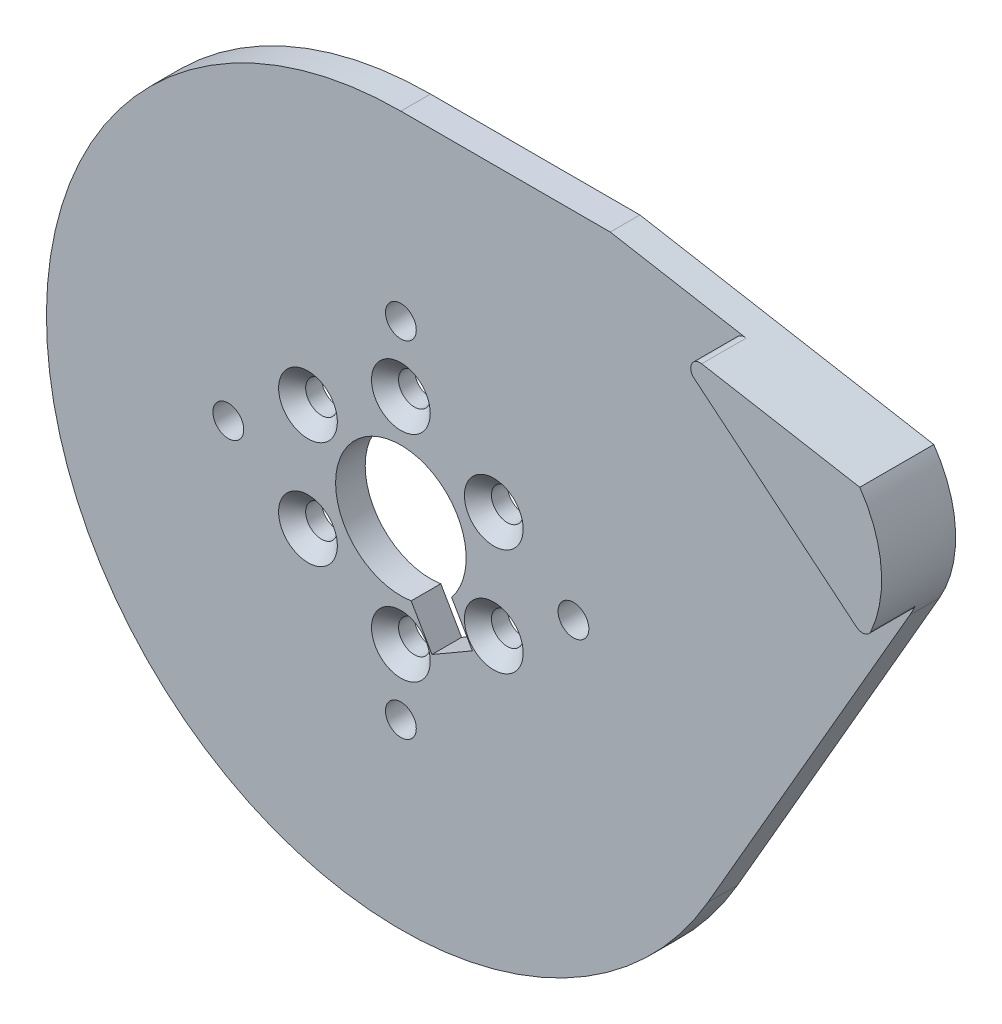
ISO-10303-21;
HEADER;
FILE_DESCRIPTION(('STEP AP214'),'2;1');
FILE_NAME('part.step','',(''),(''),'','','');
FILE_SCHEMA(('AUTOMOTIVE_DESIGN { 1 0 10303 214 1 1 1 1 }'));
ENDSEC;
DATA;
#1=APPLICATION_CONTEXT('core data for automotive mechanical design processes');
#2=APPLICATION_PROTOCOL_DEFINITION('international standard','automotive_design',2000,#1);
#3=PRODUCT_CONTEXT('',#1,'mechanical');
#4=PRODUCT('Part','Part','',(#3));
#5=PRODUCT_RELATED_PRODUCT_CATEGORY('part','',(#4));
#6=PRODUCT_DEFINITION_FORMATION('','',#4);
#7=PRODUCT_DEFINITION_CONTEXT('part definition',#1,'design');
#8=PRODUCT_DEFINITION('design','',#6,#7);
#9=PRODUCT_DEFINITION_SHAPE('','',#8);
#10=(LENGTH_UNIT() NAMED_UNIT(*) SI_UNIT(.MILLI.,.METRE.));
#11=(NAMED_UNIT(*) PLANE_ANGLE_UNIT() SI_UNIT($,.RADIAN.));
#12=(NAMED_UNIT(*) SI_UNIT($,.STERADIAN.) SOLID_ANGLE_UNIT());
#13=UNCERTAINTY_MEASURE_WITH_UNIT(LENGTH_MEASURE(1.E-05),#10,'distance_accuracy_value','');
#14=(GEOMETRIC_REPRESENTATION_CONTEXT(3) GLOBAL_UNCERTAINTY_ASSIGNED_CONTEXT((#13)) GLOBAL_UNIT_ASSIGNED_CONTEXT((#10,
#11,#12)) REPRESENTATION_CONTEXT('',''));
#15=CARTESIAN_POINT('',(0.,0.,0.));
#16=DIRECTION('',(0.,0.,1.));
#17=DIRECTION('',(1.,0.,0.));
#18=AXIS2_PLACEMENT_3D('',#15,#16,#17);
#19=CARTESIAN_POINT('',(43.3012701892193,24.9999999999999,0.));
#20=DIRECTION('',(0.,0.,1.));
#21=DIRECTION('',(1.,0.,0.));
#22=AXIS2_PLACEMENT_3D('',#19,#20,#21);
#23=CYLINDRICAL_SURFACE('',#22,13.0000000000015);
#24=CARTESIAN_POINT('',(43.3012701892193,24.9999999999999,3.175));
#25=DIRECTION('',(0.,0.,1.));
#26=DIRECTION('',(1.,0.,0.));
#27=AXIS2_PLACEMENT_3D('',#24,#25,#26);
#28=CIRCLE('',#27,13.0000000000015);
#29=CARTESIAN_POINT('',(54.5596004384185,18.4999999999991,3.175));
#30=VERTEX_POINT('',#29);
#31=CARTESIAN_POINT('',(55.1499676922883,19.6513209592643,3.175));
#32=VERTEX_POINT('',#31);
#33=EDGE_CURVE('E147',#30,#32,#28,.T.);
#34=ORIENTED_EDGE('',*,*,#33,.F.);
#35=DIRECTION('',(0.,0.,1.));
#36=VECTOR('',#35,1.);
#37=CARTESIAN_POINT('',(54.5596004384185,18.4999999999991,0.));
#38=LINE('',#37,#36);
#39=CARTESIAN_POINT('',(54.5596004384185,18.4999999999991,0.));
#40=VERTEX_POINT('',#39);
#41=EDGE_CURVE('E11',#40,#30,#38,.T.);
#42=ORIENTED_EDGE('',*,*,#41,.F.);
#43=CARTESIAN_POINT('',(43.3012701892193,24.9999999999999,0.));
#44=DIRECTION('',(0.,0.,1.));
#45=DIRECTION('',(1.,0.,0.));
#46=AXIS2_PLACEMENT_3D('',#43,#44,#45);
#47=CIRCLE('',#46,13.0000000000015);
#48=CARTESIAN_POINT('',(53.9595020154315,32.4432583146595,0.));
#49=VERTEX_POINT('',#48);
#50=EDGE_CURVE('E170',#40,#49,#47,.T.);
#51=ORIENTED_EDGE('',*,*,#50,.T.);
#52=DIRECTION('',(0.,0.,1.));
#53=VECTOR('',#52,1.);
#54=CARTESIAN_POINT('',(53.9595020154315,32.4432583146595,0.));
#55=LINE('',#54,#53);
#56=CARTESIAN_POINT('',(53.9595020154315,32.4432583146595,7.9375));
#57=VERTEX_POINT('',#56);
#58=EDGE_CURVE('E36',#49,#57,#55,.T.);
#59=ORIENTED_EDGE('',*,*,#58,.T.);
#60=CARTESIAN_POINT('',(43.3012701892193,24.9999999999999,7.9375));
#61=DIRECTION('',(0.,0.,1.));
#62=DIRECTION('',(-1.,0.,0.));
#63=AXIS2_PLACEMENT_3D('',#60,#61,#62);
#64=CIRCLE('',#63,13.0000000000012);
#65=CARTESIAN_POINT('',(55.149967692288,19.6513209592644,7.9375));
#66=VERTEX_POINT('',#65);
#67=EDGE_CURVE('E208',#66,#57,#64,.T.);
#68=ORIENTED_EDGE('',*,*,#67,.F.);
#69=DIRECTION('',(0.,0.,-1.));
#70=VECTOR('',#69,1.);
#71=CARTESIAN_POINT('',(55.149967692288,19.6513209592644,7.9375));
#72=LINE('',#71,#70);
#73=EDGE_CURVE('E226',#66,#32,#72,.T.);
#74=ORIENTED_EDGE('',*,*,#73,.T.);
#75=EDGE_LOOP('',(#34,#42,#51,#59,#68,#74));
#76=FACE_BOUND('',#75,.T.);
#77=ADVANCED_FACE('F33',(#76),#23,.T.);
#78=CARTESIAN_POINT('',(32.9089653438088,-18.9999999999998,0.));
#79=DIRECTION('',(0.866025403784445,-0.499999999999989,0.));
#80=DIRECTION('',(0.499999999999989,0.866025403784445,0.));
#81=AXIS2_PLACEMENT_3D('',#78,#79,#80);
#82=PLANE('',#81);
#83=DIRECTION('',(0.499999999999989,0.866025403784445,0.));
#84=VECTOR('',#83,1.);
#85=CARTESIAN_POINT('',(32.9089653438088,-18.9999999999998,3.175));
#86=LINE('',#85,#84);
#87=CARTESIAN_POINT('',(32.9089653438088,-18.9999999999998,3.175));
#88=VERTEX_POINT('',#87);
#89=EDGE_CURVE('E174',#88,#30,#86,.T.);
#90=ORIENTED_EDGE('',*,*,#89,.F.);
#91=DIRECTION('',(0.,0.,1.));
#92=VECTOR('',#91,1.);
#93=CARTESIAN_POINT('',(32.9089653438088,-18.9999999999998,0.));
#94=LINE('',#93,#92);
#95=CARTESIAN_POINT('',(32.9089653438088,-18.9999999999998,0.));
#96=VERTEX_POINT('',#95);
#97=EDGE_CURVE('E41',#96,#88,#94,.T.);
#98=ORIENTED_EDGE('',*,*,#97,.F.);
#99=DIRECTION('',(0.499999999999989,0.866025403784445,0.));
#100=VECTOR('',#99,1.);
#101=CARTESIAN_POINT('',(32.9089653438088,-18.9999999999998,0.));
#102=LINE('',#101,#100);
#103=EDGE_CURVE('E183',#96,#40,#102,.T.);
#104=ORIENTED_EDGE('',*,*,#103,.T.);
#105=ORIENTED_EDGE('',*,*,#41,.T.);
#106=EDGE_LOOP('',(#90,#98,#104,#105));
#107=FACE_BOUND('',#106,.T.);
#108=ADVANCED_FACE('F263',(#107),#82,.T.);
#109=CARTESIAN_POINT('',(0.,1.23512311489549E-12,0.));
#110=DIRECTION('',(0.,0.,1.));
#111=DIRECTION('',(1.,0.,0.));
#112=AXIS2_PLACEMENT_3D('',#109,#110,#111);
#113=CYLINDRICAL_SURFACE('',#112,38.0000000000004);
#114=CARTESIAN_POINT('',(0.,1.23512311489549E-12,3.175));
#115=DIRECTION('',(0.,0.,1.));
#116=DIRECTION('',(1.,0.,0.));
#117=AXIS2_PLACEMENT_3D('',#114,#115,#116);
#118=CIRCLE('',#117,38.0000000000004);
#119=CARTESIAN_POINT('',(0.,38.0000000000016,3.175));
#120=VERTEX_POINT('',#119);
#121=EDGE_CURVE('E192',#120,#88,#118,.T.);
#122=ORIENTED_EDGE('',*,*,#121,.F.);
#123=DIRECTION('',(0.,0.,1.));
#124=VECTOR('',#123,1.);
#125=CARTESIAN_POINT('',(0.,38.0000000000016,0.));
#126=LINE('',#125,#124);
#127=CARTESIAN_POINT('',(0.,38.0000000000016,0.));
#128=VERTEX_POINT('',#127);
#129=EDGE_CURVE('E198',#128,#120,#126,.T.);
#130=ORIENTED_EDGE('',*,*,#129,.F.);
#131=CARTESIAN_POINT('',(0.,1.23512311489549E-12,0.));
#132=DIRECTION('',(0.,0.,1.));
#133=DIRECTION('',(1.,0.,0.));
#134=AXIS2_PLACEMENT_3D('',#131,#132,#133);
#135=CIRCLE('',#134,38.0000000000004);
#136=EDGE_CURVE('E180',#128,#96,#135,.T.);
#137=ORIENTED_EDGE('',*,*,#136,.T.);
#138=ORIENTED_EDGE('',*,*,#97,.T.);
#139=EDGE_LOOP('',(#122,#130,#137,#138));
#140=FACE_BOUND('',#139,.T.);
#141=ADVANCED_FACE('F267',(#140),#113,.T.);
#142=CARTESIAN_POINT('',(22.4456539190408,38.0000000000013,0.));
#143=DIRECTION('',(0.,1.,0.));
#144=DIRECTION('',(-1.,0.,0.));
#145=AXIS2_PLACEMENT_3D('',#142,#143,#144);
#146=PLANE('',#145);
#147=DIRECTION('',(-1.,0.,0.));
#148=VECTOR('',#147,1.);
#149=CARTESIAN_POINT('',(22.4456539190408,38.0000000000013,3.175));
#150=LINE('',#149,#148);
#151=CARTESIAN_POINT('',(22.4456539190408,38.0000000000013,3.175));
#152=VERTEX_POINT('',#151);
#153=EDGE_CURVE('E189',#152,#120,#150,.T.);
#154=ORIENTED_EDGE('',*,*,#153,.F.);
#155=DIRECTION('',(0.,0.,1.));
#156=VECTOR('',#155,1.);
#157=CARTESIAN_POINT('',(22.4456539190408,38.0000000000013,0.));
#158=LINE('',#157,#156);
#159=CARTESIAN_POINT('',(22.4456539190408,38.0000000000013,0.));
#160=VERTEX_POINT('',#159);
#161=EDGE_CURVE('E199',#160,#152,#158,.T.);
#162=ORIENTED_EDGE('',*,*,#161,.F.);
#163=DIRECTION('',(-1.,0.,0.));
#164=VECTOR('',#163,1.);
#165=CARTESIAN_POINT('',(22.4456539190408,38.0000000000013,0.));
#166=LINE('',#165,#164);
#167=EDGE_CURVE('E177',#160,#128,#166,.T.);
#168=ORIENTED_EDGE('',*,*,#167,.T.);
#169=ORIENTED_EDGE('',*,*,#129,.T.);
#170=EDGE_LOOP('',(#154,#162,#168,#169));
#171=FACE_BOUND('',#170,.T.);
#172=ADVANCED_FACE('F273',(#171),#146,.T.);
#173=CARTESIAN_POINT('',(53.9595020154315,32.4432583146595,0.));
#174=DIRECTION('',(0.173648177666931,0.984807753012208,0.));
#175=DIRECTION('',(-0.984807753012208,0.173648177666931,0.));
#176=AXIS2_PLACEMENT_3D('',#173,#174,#175);
#177=PLANE('',#176);
#178=DIRECTION('',(-0.984807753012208,0.173648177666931,0.));
#179=VECTOR('',#178,1.);
#180=CARTESIAN_POINT('',(53.9595020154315,32.4432583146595,3.175));
#181=LINE('',#180,#179);
#182=CARTESIAN_POINT('',(37.0091232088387,35.4320674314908,3.175));
#183=VERTEX_POINT('',#182);
#184=EDGE_CURVE('E187',#183,#152,#181,.T.);
#185=ORIENTED_EDGE('',*,*,#184,.F.);
#186=DIRECTION('',(0.,0.,-1.));
#187=VECTOR('',#186,1.);
#188=CARTESIAN_POINT('',(37.0091232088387,35.4320674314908,7.9375));
#189=LINE('',#188,#187);
#190=CARTESIAN_POINT('',(37.0091232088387,35.4320674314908,7.9375));
#191=VERTEX_POINT('',#190);
#192=EDGE_CURVE('E223',#191,#183,#189,.T.);
#193=ORIENTED_EDGE('',*,*,#192,.F.);
#194=DIRECTION('',(-0.984807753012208,0.173648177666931,0.));
#195=VECTOR('',#194,1.);
#196=CARTESIAN_POINT('',(37.0091232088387,35.4320674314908,7.9375));
#197=LINE('',#196,#195);
#198=EDGE_CURVE('E215',#57,#191,#197,.T.);
#199=ORIENTED_EDGE('',*,*,#198,.F.);
#200=ORIENTED_EDGE('',*,*,#58,.F.);
#201=DIRECTION('',(-0.984807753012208,0.173648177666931,0.));
#202=VECTOR('',#201,1.);
#203=CARTESIAN_POINT('',(53.9595020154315,32.4432583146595,0.));
#204=LINE('',#203,#202);
#205=EDGE_CURVE('E173',#49,#160,#204,.T.);
#206=ORIENTED_EDGE('',*,*,#205,.T.);
#207=ORIENTED_EDGE('',*,*,#161,.T.);
#208=EDGE_LOOP('',(#185,#193,#199,#200,#206,#207));
#209=FACE_BOUND('',#208,.T.);
#210=ADVANCED_FACE('F221',(#209),#177,.T.);
#211=CARTESIAN_POINT('',(43.3012701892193,24.9999999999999,0.));
#212=DIRECTION('',(0.,0.,1.));
#213=DIRECTION('',(1.,0.,0.));
#214=AXIS2_PLACEMENT_3D('',#211,#212,#213);
#215=PLANE('',#214);
#216=CARTESIAN_POINT('',(-9.95929214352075,5.74999999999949,0.));
#217=DIRECTION('',(0.,0.,1.));
#218=DIRECTION('',(1.,0.,0.));
#219=AXIS2_PLACEMENT_3D('',#216,#217,#218);
#220=CIRCLE('',#219,1.69999999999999);
#221=CARTESIAN_POINT('',(-8.25929214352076,5.74999999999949,0.));
#222=VERTEX_POINT('',#221);
#223=EDGE_CURVE('E574',#222,#222,#220,.T.);
#224=ORIENTED_EDGE('',*,*,#223,.T.);
#225=EDGE_LOOP('',(#224));
#226=FACE_BOUND('',#225,.T.);
#227=CARTESIAN_POINT('',(-9.95929214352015,-5.75000000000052,0.));
#228=DIRECTION('',(0.,0.,1.));
#229=DIRECTION('',(1.,0.,0.));
#230=AXIS2_PLACEMENT_3D('',#227,#228,#229);
#231=CIRCLE('',#230,1.69999999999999);
#232=CARTESIAN_POINT('',(-8.25929214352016,-5.75000000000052,0.));
#233=VERTEX_POINT('',#232);
#234=EDGE_CURVE('E565',#233,#233,#231,.T.);
#235=ORIENTED_EDGE('',*,*,#234,.T.);
#236=EDGE_LOOP('',(#235));
#237=FACE_BOUND('',#236,.T.);
#238=CARTESIAN_POINT('',(1.19132134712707E-12,-11.5,0.));
#239=DIRECTION('',(0.,0.,1.));
#240=DIRECTION('',(1.,0.,0.));
#241=AXIS2_PLACEMENT_3D('',#238,#239,#240);
#242=CIRCLE('',#241,1.69999999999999);
#243=CARTESIAN_POINT('',(1.70000000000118,-11.5,0.));
#244=VERTEX_POINT('',#243);
#245=EDGE_CURVE('E556',#244,#244,#242,.T.);
#246=ORIENTED_EDGE('',*,*,#245,.T.);
#247=EDGE_LOOP('',(#246));
#248=FACE_BOUND('',#247,.T.);
#249=CARTESIAN_POINT('',(9.95929214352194,-5.74999999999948,0.));
#250=DIRECTION('',(0.,0.,1.));
#251=DIRECTION('',(1.,0.,0.));
#252=AXIS2_PLACEMENT_3D('',#249,#250,#251);
#253=CIRCLE('',#252,1.69999999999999);
#254=CARTESIAN_POINT('',(11.6592921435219,-5.74999999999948,0.));
#255=VERTEX_POINT('',#254);
#256=EDGE_CURVE('E547',#255,#255,#253,.T.);
#257=ORIENTED_EDGE('',*,*,#256,.T.);
#258=EDGE_LOOP('',(#257));
#259=FACE_BOUND('',#258,.T.);
#260=CARTESIAN_POINT('',(9.95929214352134,5.75000000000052,0.));
#261=DIRECTION('',(0.,0.,1.));
#262=DIRECTION('',(1.,0.,0.));
#263=AXIS2_PLACEMENT_3D('',#260,#261,#262);
#264=CIRCLE('',#263,1.69999999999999);
#265=CARTESIAN_POINT('',(11.6592921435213,5.75000000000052,0.));
#266=VERTEX_POINT('',#265);
#267=EDGE_CURVE('E538',#266,#266,#264,.T.);
#268=ORIENTED_EDGE('',*,*,#267,.T.);
#269=EDGE_LOOP('',(#268));
#270=FACE_BOUND('',#269,.T.);
#271=CARTESIAN_POINT('',(0.,11.5,0.));
#272=DIRECTION('',(0.,0.,1.));
#273=DIRECTION('',(1.,0.,0.));
#274=AXIS2_PLACEMENT_3D('',#271,#272,#273);
#275=CIRCLE('',#274,1.69999999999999);
#276=CARTESIAN_POINT('',(1.69999999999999,11.5,0.));
#277=VERTEX_POINT('',#276);
#278=EDGE_CURVE('E529',#277,#277,#275,.T.);
#279=ORIENTED_EDGE('',*,*,#278,.T.);
#280=EDGE_LOOP('',(#279));
#281=FACE_BOUND('',#280,.T.);
#282=CARTESIAN_POINT('',(18.5000000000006,5.80012052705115E-13,0.));
#283=DIRECTION('',(0.,0.,1.));
#284=DIRECTION('',(1.,0.,0.));
#285=AXIS2_PLACEMENT_3D('',#282,#283,#284);
#286=CIRCLE('',#285,1.64999999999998);
#287=CARTESIAN_POINT('',(20.1500000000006,5.80012052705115E-13,0.));
#288=VERTEX_POINT('',#287);
#289=EDGE_CURVE('E523',#288,#288,#286,.T.);
#290=ORIENTED_EDGE('',*,*,#289,.T.);
#291=EDGE_LOOP('',(#290));
#292=FACE_BOUND('',#291,.T.);
#293=CARTESIAN_POINT('',(1.16002410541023E-12,-18.5,0.));
#294=DIRECTION('',(0.,0.,1.));
#295=DIRECTION('',(1.,0.,0.));
#296=AXIS2_PLACEMENT_3D('',#293,#294,#295);
#297=CIRCLE('',#296,1.64999999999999);
#298=CARTESIAN_POINT('',(1.65000000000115,-18.5,0.));
#299=VERTEX_POINT('',#298);
#300=EDGE_CURVE('E517',#299,#299,#297,.T.);
#301=ORIENTED_EDGE('',*,*,#300,.T.);
#302=EDGE_LOOP('',(#301));
#303=FACE_BOUND('',#302,.T.);
#304=CARTESIAN_POINT('',(-18.4999999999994,-5.82277649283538E-13,0.));
#305=DIRECTION('',(0.,0.,1.));
#306=DIRECTION('',(1.,0.,0.));
#307=AXIS2_PLACEMENT_3D('',#304,#305,#306);
#308=CIRCLE('',#307,1.64999999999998);
#309=CARTESIAN_POINT('',(-16.8499999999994,-5.82277649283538E-13,0.));
#310=VERTEX_POINT('',#309);
#311=EDGE_CURVE('E511',#310,#310,#308,.T.);
#312=ORIENTED_EDGE('',*,*,#311,.T.);
#313=EDGE_LOOP('',(#312));
#314=FACE_BOUND('',#313,.T.);
#315=CARTESIAN_POINT('',(0.,18.5,0.));
#316=DIRECTION('',(0.,0.,1.));
#317=DIRECTION('',(1.,0.,0.));
#318=AXIS2_PLACEMENT_3D('',#315,#316,#317);
#319=CIRCLE('',#318,1.64999999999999);
#320=CARTESIAN_POINT('',(1.64999999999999,18.5,0.));
#321=VERTEX_POINT('',#320);
#322=EDGE_CURVE('E138',#321,#321,#319,.T.);
#323=ORIENTED_EDGE('',*,*,#322,.T.);
#324=EDGE_LOOP('',(#323));
#325=FACE_BOUND('',#324,.T.);
#326=DIRECTION('',(0.5,-0.866025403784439,0.));
#327=VECTOR('',#326,1.);
#328=CARTESIAN_POINT('',(5.43423771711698,-4.4123758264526,0.));
#329=LINE('',#328,#327);
#330=CARTESIAN_POINT('',(5.43423771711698,-4.4123758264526,0.));
#331=VERTEX_POINT('',#330);
#332=CARTESIAN_POINT('',(7.66506350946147,-8.27627944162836,0.));
#333=VERTEX_POINT('',#332);
#334=EDGE_CURVE('E143',#331,#333,#329,.T.);
#335=ORIENTED_EDGE('',*,*,#334,.F.);
#336=CARTESIAN_POINT('',(0.,0.,0.));
#337=DIRECTION('',(0.,0.,-1.));
#338=DIRECTION('',(-1.,0.,0.));
#339=AXIS2_PLACEMENT_3D('',#336,#337,#338);
#340=CIRCLE('',#339,7.);
#341=CARTESIAN_POINT('',(1.10411069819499,-6.91237582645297,0.));
#342=VERTEX_POINT('',#341);
#343=EDGE_CURVE('E126',#342,#331,#340,.T.);
#344=ORIENTED_EDGE('',*,*,#343,.F.);
#345=DIRECTION('',(-0.5,0.866025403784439,0.));
#346=VECTOR('',#345,1.);
#347=CARTESIAN_POINT('',(3.33493649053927,-10.7762794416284,0.));
#348=LINE('',#347,#346);
#349=CARTESIAN_POINT('',(3.33493649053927,-10.7762794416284,0.));
#350=VERTEX_POINT('',#349);
#351=EDGE_CURVE('E156',#350,#342,#348,.T.);
#352=ORIENTED_EDGE('',*,*,#351,.F.);
#353=DIRECTION('',(-0.866025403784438,-0.5,0.));
#354=VECTOR('',#353,1.);
#355=CARTESIAN_POINT('',(7.66506350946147,-8.27627944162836,0.));
#356=LINE('',#355,#354);
#357=EDGE_CURVE('E153',#333,#350,#356,.T.);
#358=ORIENTED_EDGE('',*,*,#357,.F.);
#359=EDGE_LOOP('',(#335,#344,#352,#358));
#360=FACE_BOUND('',#359,.T.);
#361=ORIENTED_EDGE('',*,*,#50,.F.);
#362=ORIENTED_EDGE('',*,*,#103,.F.);
#363=ORIENTED_EDGE('',*,*,#136,.F.);
#364=ORIENTED_EDGE('',*,*,#167,.F.);
#365=ORIENTED_EDGE('',*,*,#205,.F.);
#366=EDGE_LOOP('',(#361,#362,#363,#364,#365));
#367=FACE_BOUND('',#366,.T.);
#368=ADVANCED_FACE('F150',(#226,#237,#248,#259,#270,#281,#292,#303,#314,#325,#360,#367),#215,.F.);
#369=CARTESIAN_POINT('',(43.3012701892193,24.9999999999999,3.175));
#370=DIRECTION('',(0.,0.,1.));
#371=DIRECTION('',(1.,0.,0.));
#372=AXIS2_PLACEMENT_3D('',#369,#370,#371);
#373=PLANE('',#372);
#374=CARTESIAN_POINT('',(-9.95929214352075,5.74999999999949,3.175));
#375=DIRECTION('',(0.,0.,1.));
#376=DIRECTION('',(1.,0.,0.));
#377=AXIS2_PLACEMENT_3D('',#374,#375,#376);
#378=CIRCLE('',#377,3.1499999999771);
#379=CARTESIAN_POINT('',(-6.80929214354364,5.74999999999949,3.175));
#380=VERTEX_POINT('',#379);
#381=EDGE_CURVE('E579',#380,#380,#378,.T.);
#382=ORIENTED_EDGE('',*,*,#381,.F.);
#383=EDGE_LOOP('',(#382));
#384=FACE_BOUND('',#383,.T.);
#385=CARTESIAN_POINT('',(-9.95929214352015,-5.75000000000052,3.175));
#386=DIRECTION('',(0.,0.,1.));
#387=DIRECTION('',(1.,0.,0.));
#388=AXIS2_PLACEMENT_3D('',#385,#386,#387);
#389=CIRCLE('',#388,3.1499999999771);
#390=CARTESIAN_POINT('',(-6.80929214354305,-5.75000000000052,3.175));
#391=VERTEX_POINT('',#390);
#392=EDGE_CURVE('E571',#391,#391,#389,.T.);
#393=ORIENTED_EDGE('',*,*,#392,.F.);
#394=EDGE_LOOP('',(#393));
#395=FACE_BOUND('',#394,.T.);
#396=CARTESIAN_POINT('',(1.19132134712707E-12,-11.5,3.175));
#397=DIRECTION('',(0.,0.,1.));
#398=DIRECTION('',(1.,0.,0.));
#399=AXIS2_PLACEMENT_3D('',#396,#397,#398);
#400=CIRCLE('',#399,3.1499999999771);
#401=CARTESIAN_POINT('',(3.14999999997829,-11.5,3.175));
#402=VERTEX_POINT('',#401);
#403=EDGE_CURVE('E562',#402,#402,#400,.T.);
#404=ORIENTED_EDGE('',*,*,#403,.F.);
#405=EDGE_LOOP('',(#404));
#406=FACE_BOUND('',#405,.T.);
#407=CARTESIAN_POINT('',(9.95929214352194,-5.74999999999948,3.175));
#408=DIRECTION('',(0.,0.,1.));
#409=DIRECTION('',(1.,0.,0.));
#410=AXIS2_PLACEMENT_3D('',#407,#408,#409);
#411=CIRCLE('',#410,3.1499999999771);
#412=CARTESIAN_POINT('',(13.109292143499,-5.74999999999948,3.175));
#413=VERTEX_POINT('',#412);
#414=EDGE_CURVE('E553',#413,#413,#411,.T.);
#415=ORIENTED_EDGE('',*,*,#414,.F.);
#416=EDGE_LOOP('',(#415));
#417=FACE_BOUND('',#416,.T.);
#418=CARTESIAN_POINT('',(9.95929214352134,5.75000000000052,3.175));
#419=DIRECTION('',(0.,0.,1.));
#420=DIRECTION('',(1.,0.,0.));
#421=AXIS2_PLACEMENT_3D('',#418,#419,#420);
#422=CIRCLE('',#421,3.1499999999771);
#423=CARTESIAN_POINT('',(13.1092921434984,5.75000000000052,3.175));
#424=VERTEX_POINT('',#423);
#425=EDGE_CURVE('E544',#424,#424,#422,.T.);
#426=ORIENTED_EDGE('',*,*,#425,.F.);
#427=EDGE_LOOP('',(#426));
#428=FACE_BOUND('',#427,.T.);
#429=CARTESIAN_POINT('',(0.,11.5,3.175));
#430=DIRECTION('',(0.,0.,1.));
#431=DIRECTION('',(1.,0.,0.));
#432=AXIS2_PLACEMENT_3D('',#429,#430,#431);
#433=CIRCLE('',#432,3.1499999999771);
#434=CARTESIAN_POINT('',(3.1499999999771,11.5,3.175));
#435=VERTEX_POINT('',#434);
#436=EDGE_CURVE('E535',#435,#435,#433,.T.);
#437=ORIENTED_EDGE('',*,*,#436,.F.);
#438=EDGE_LOOP('',(#437));
#439=FACE_BOUND('',#438,.T.);
#440=CARTESIAN_POINT('',(18.5000000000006,5.80012052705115E-13,3.175));
#441=DIRECTION('',(0.,0.,1.));
#442=DIRECTION('',(1.,0.,0.));
#443=AXIS2_PLACEMENT_3D('',#440,#441,#442);
#444=CIRCLE('',#443,1.64999999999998);
#445=CARTESIAN_POINT('',(20.1500000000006,5.80012052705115E-13,3.175));
#446=VERTEX_POINT('',#445);
#447=EDGE_CURVE('E526',#446,#446,#444,.T.);
#448=ORIENTED_EDGE('',*,*,#447,.F.);
#449=EDGE_LOOP('',(#448));
#450=FACE_BOUND('',#449,.T.);
#451=CARTESIAN_POINT('',(1.16002410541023E-12,-18.5,3.175));
#452=DIRECTION('',(0.,0.,1.));
#453=DIRECTION('',(1.,0.,0.));
#454=AXIS2_PLACEMENT_3D('',#451,#452,#453);
#455=CIRCLE('',#454,1.64999999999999);
#456=CARTESIAN_POINT('',(1.65000000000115,-18.5,3.175));
#457=VERTEX_POINT('',#456);
#458=EDGE_CURVE('E520',#457,#457,#455,.T.);
#459=ORIENTED_EDGE('',*,*,#458,.F.);
#460=EDGE_LOOP('',(#459));
#461=FACE_BOUND('',#460,.T.);
#462=CARTESIAN_POINT('',(-18.4999999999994,-5.82277649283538E-13,3.175));
#463=DIRECTION('',(0.,0.,1.));
#464=DIRECTION('',(1.,0.,0.));
#465=AXIS2_PLACEMENT_3D('',#462,#463,#464);
#466=CIRCLE('',#465,1.64999999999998);
#467=CARTESIAN_POINT('',(-16.8499999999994,-5.82277649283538E-13,3.175));
#468=VERTEX_POINT('',#467);
#469=EDGE_CURVE('E514',#468,#468,#466,.T.);
#470=ORIENTED_EDGE('',*,*,#469,.F.);
#471=EDGE_LOOP('',(#470));
#472=FACE_BOUND('',#471,.T.);
#473=CARTESIAN_POINT('',(0.,18.5,3.175));
#474=DIRECTION('',(0.,0.,1.));
#475=DIRECTION('',(1.,0.,0.));
#476=AXIS2_PLACEMENT_3D('',#473,#474,#475);
#477=CIRCLE('',#476,1.64999999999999);
#478=CARTESIAN_POINT('',(1.64999999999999,18.5,3.175));
#479=VERTEX_POINT('',#478);
#480=EDGE_CURVE('E508',#479,#479,#477,.T.);
#481=ORIENTED_EDGE('',*,*,#480,.F.);
#482=EDGE_LOOP('',(#481));
#483=FACE_BOUND('',#482,.T.);
#484=CARTESIAN_POINT('',(0.,0.,3.175));
#485=DIRECTION('',(0.,0.,-1.));
#486=DIRECTION('',(-1.,0.,0.));
#487=AXIS2_PLACEMENT_3D('',#484,#485,#486);
#488=CIRCLE('',#487,7.);
#489=CARTESIAN_POINT('',(1.10411069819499,-6.91237582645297,3.175));
#490=VERTEX_POINT('',#489);
#491=CARTESIAN_POINT('',(5.43423771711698,-4.4123758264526,3.175));
#492=VERTEX_POINT('',#491);
#493=EDGE_CURVE('E137',#490,#492,#488,.T.);
#494=ORIENTED_EDGE('',*,*,#493,.T.);
#495=DIRECTION('',(0.5,-0.866025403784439,0.));
#496=VECTOR('',#495,1.);
#497=CARTESIAN_POINT('',(5.43423771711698,-4.4123758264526,3.175));
#498=LINE('',#497,#496);
#499=CARTESIAN_POINT('',(7.66506350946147,-8.27627944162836,3.175));
#500=VERTEX_POINT('',#499);
#501=EDGE_CURVE('E146',#492,#500,#498,.T.);
#502=ORIENTED_EDGE('',*,*,#501,.T.);
#503=DIRECTION('',(-0.866025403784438,-0.5,0.));
#504=VECTOR('',#503,1.);
#505=CARTESIAN_POINT('',(7.66506350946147,-8.27627944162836,3.175));
#506=LINE('',#505,#504);
#507=CARTESIAN_POINT('',(3.33493649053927,-10.7762794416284,3.175));
#508=VERTEX_POINT('',#507);
#509=EDGE_CURVE('E239',#500,#508,#506,.T.);
#510=ORIENTED_EDGE('',*,*,#509,.T.);
#511=DIRECTION('',(-0.5,0.866025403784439,0.));
#512=VECTOR('',#511,1.);
#513=CARTESIAN_POINT('',(3.33493649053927,-10.7762794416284,3.175));
#514=LINE('',#513,#512);
#515=EDGE_CURVE('E161',#508,#490,#514,.T.);
#516=ORIENTED_EDGE('',*,*,#515,.T.);
#517=EDGE_LOOP('',(#494,#502,#510,#516));
#518=FACE_BOUND('',#517,.T.);
#519=CARTESIAN_POINT('',(36.8354750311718,34.4472596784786,3.175));
#520=DIRECTION('',(0.,0.,1.));
#521=DIRECTION('',(-1.,0.,0.));
#522=AXIS2_PLACEMENT_3D('',#519,#520,#521);
#523=CIRCLE('',#522,0.999999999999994);
#524=CARTESIAN_POINT('',(36.1983812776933,33.6764733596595,3.175));
#525=VERTEX_POINT('',#524);
#526=EDGE_CURVE('E54',#183,#525,#523,.T.);
#527=ORIENTED_EDGE('',*,*,#526,.F.);
#528=ORIENTED_EDGE('',*,*,#184,.T.);
#529=ORIENTED_EDGE('',*,*,#153,.T.);
#530=ORIENTED_EDGE('',*,*,#121,.T.);
#531=ORIENTED_EDGE('',*,*,#89,.T.);
#532=ORIENTED_EDGE('',*,*,#33,.T.);
#533=CARTESIAN_POINT('',(54.2385294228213,20.0627578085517,3.175));
#534=DIRECTION('',(0.,0.,1.));
#535=DIRECTION('',(-1.,0.,0.));
#536=AXIS2_PLACEMENT_3D('',#533,#534,#535);
#537=CIRCLE('',#536,1.);
#538=CARTESIAN_POINT('',(53.6014356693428,19.2919714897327,3.175));
#539=VERTEX_POINT('',#538);
#540=EDGE_CURVE('E232',#539,#32,#537,.T.);
#541=ORIENTED_EDGE('',*,*,#540,.F.);
#542=DIRECTION('',(0.770786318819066,-0.637093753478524,0.));
#543=VECTOR('',#542,1.);
#544=CARTESIAN_POINT('',(53.6014356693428,19.2919714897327,3.175));
#545=LINE('',#544,#543);
#546=EDGE_CURVE('E49',#525,#539,#545,.T.);
#547=ORIENTED_EDGE('',*,*,#546,.F.);
#548=EDGE_LOOP('',(#527,#528,#529,#530,#531,#532,#541,#547));
#549=FACE_BOUND('',#548,.T.);
#550=ADVANCED_FACE('F244',(#384,#395,#406,#417,#428,#439,#450,#461,#472,#483,#518,#549),#373,.T.);
#551=CARTESIAN_POINT('',(5.43423771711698,-4.4123758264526,3.175));
#552=DIRECTION('',(0.866025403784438,0.5,0.));
#553=DIRECTION('',(-0.5,0.866025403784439,0.));
#554=AXIS2_PLACEMENT_3D('',#551,#552,#553);
#555=PLANE('',#554);
#556=ORIENTED_EDGE('',*,*,#334,.T.);
#557=DIRECTION('',(0.,0.,-1.));
#558=VECTOR('',#557,1.);
#559=CARTESIAN_POINT('',(7.66506350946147,-8.27627944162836,3.175));
#560=LINE('',#559,#558);
#561=EDGE_CURVE('E168',#500,#333,#560,.T.);
#562=ORIENTED_EDGE('',*,*,#561,.F.);
#563=ORIENTED_EDGE('',*,*,#501,.F.);
#564=DIRECTION('',(0.,0.,-1.));
#565=VECTOR('',#564,1.);
#566=CARTESIAN_POINT('',(5.43423771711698,-4.4123758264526,3.175));
#567=LINE('',#566,#565);
#568=EDGE_CURVE('E129',#492,#331,#567,.T.);
#569=ORIENTED_EDGE('',*,*,#568,.T.);
#570=EDGE_LOOP('',(#556,#562,#563,#569));
#571=FACE_BOUND('',#570,.T.);
#572=ADVANCED_FACE('F142',(#571),#555,.F.);
#573=CARTESIAN_POINT('',(3.33493649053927,-10.7762794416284,3.175));
#574=DIRECTION('',(-0.866025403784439,-0.5,0.));
#575=DIRECTION('',(0.5,-0.866025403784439,0.));
#576=AXIS2_PLACEMENT_3D('',#573,#574,#575);
#577=PLANE('',#576);
#578=ORIENTED_EDGE('',*,*,#351,.T.);
#579=DIRECTION('',(0.,0.,-1.));
#580=VECTOR('',#579,1.);
#581=CARTESIAN_POINT('',(1.10411069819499,-6.91237582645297,3.175));
#582=LINE('',#581,#580);
#583=EDGE_CURVE('E132',#490,#342,#582,.T.);
#584=ORIENTED_EDGE('',*,*,#583,.F.);
#585=ORIENTED_EDGE('',*,*,#515,.F.);
#586=DIRECTION('',(0.,0.,-1.));
#587=VECTOR('',#586,1.);
#588=CARTESIAN_POINT('',(3.33493649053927,-10.7762794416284,3.175));
#589=LINE('',#588,#587);
#590=EDGE_CURVE('E166',#508,#350,#589,.T.);
#591=ORIENTED_EDGE('',*,*,#590,.T.);
#592=EDGE_LOOP('',(#578,#584,#585,#591));
#593=FACE_BOUND('',#592,.T.);
#594=ADVANCED_FACE('F247',(#593),#577,.F.);
#595=CARTESIAN_POINT('',(7.66506350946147,-8.27627944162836,3.175));
#596=DIRECTION('',(0.5,-0.866025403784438,0.));
#597=DIRECTION('',(0.866025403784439,0.5,0.));
#598=AXIS2_PLACEMENT_3D('',#595,#596,#597);
#599=PLANE('',#598);
#600=ORIENTED_EDGE('',*,*,#357,.T.);
#601=ORIENTED_EDGE('',*,*,#590,.F.);
#602=ORIENTED_EDGE('',*,*,#509,.F.);
#603=ORIENTED_EDGE('',*,*,#561,.T.);
#604=EDGE_LOOP('',(#600,#601,#602,#603));
#605=FACE_BOUND('',#604,.T.);
#606=ADVANCED_FACE('F249',(#605),#599,.F.);
#607=CARTESIAN_POINT('',(36.8354750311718,34.4472596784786,7.9375));
#608=DIRECTION('',(0.,0.,-1.));
#609=DIRECTION('',(-1.,0.,0.));
#610=AXIS2_PLACEMENT_3D('',#607,#608,#609);
#611=CYLINDRICAL_SURFACE('',#610,0.999999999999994);
#612=ORIENTED_EDGE('',*,*,#526,.T.);
#613=DIRECTION('',(0.,0.,-1.));
#614=VECTOR('',#613,1.);
#615=CARTESIAN_POINT('',(36.1983812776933,33.6764733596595,7.9375));
#616=LINE('',#615,#614);
#617=CARTESIAN_POINT('',(36.1983812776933,33.6764733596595,7.9375));
#618=VERTEX_POINT('',#617);
#619=EDGE_CURVE('E154',#618,#525,#616,.T.);
#620=ORIENTED_EDGE('',*,*,#619,.F.);
#621=CARTESIAN_POINT('',(36.8354750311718,34.4472596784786,7.9375));
#622=DIRECTION('',(0.,0.,1.));
#623=DIRECTION('',(-1.,0.,0.));
#624=AXIS2_PLACEMENT_3D('',#621,#622,#623);
#625=CIRCLE('',#624,0.999999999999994);
#626=EDGE_CURVE('E234',#191,#618,#625,.T.);
#627=ORIENTED_EDGE('',*,*,#626,.F.);
#628=ORIENTED_EDGE('',*,*,#192,.T.);
#629=EDGE_LOOP('',(#612,#620,#627,#628));
#630=FACE_BOUND('',#629,.T.);
#631=ADVANCED_FACE('F251',(#630),#611,.T.);
#632=CARTESIAN_POINT('',(53.6014356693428,19.2919714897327,7.9375));
#633=DIRECTION('',(0.637093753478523,0.770786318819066,0.));
#634=DIRECTION('',(-0.770786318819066,0.637093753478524,0.));
#635=AXIS2_PLACEMENT_3D('',#632,#633,#634);
#636=PLANE('',#635);
#637=ORIENTED_EDGE('',*,*,#546,.T.);
#638=DIRECTION('',(0.,0.,-1.));
#639=VECTOR('',#638,1.);
#640=CARTESIAN_POINT('',(53.6014356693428,19.2919714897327,7.9375));
#641=LINE('',#640,#639);
#642=CARTESIAN_POINT('',(53.6014356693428,19.2919714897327,7.9375));
#643=VERTEX_POINT('',#642);
#644=EDGE_CURVE('E158',#643,#539,#641,.T.);
#645=ORIENTED_EDGE('',*,*,#644,.F.);
#646=DIRECTION('',(0.770786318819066,-0.637093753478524,0.));
#647=VECTOR('',#646,1.);
#648=CARTESIAN_POINT('',(53.6014356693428,19.2919714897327,7.9375));
#649=LINE('',#648,#647);
#650=EDGE_CURVE('E501',#618,#643,#649,.T.);
#651=ORIENTED_EDGE('',*,*,#650,.F.);
#652=ORIENTED_EDGE('',*,*,#619,.T.);
#653=EDGE_LOOP('',(#637,#645,#651,#652));
#654=FACE_BOUND('',#653,.T.);
#655=ADVANCED_FACE('F257',(#654),#636,.F.);
#656=CARTESIAN_POINT('',(54.2385294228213,20.0627578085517,7.9375));
#657=DIRECTION('',(0.,0.,-1.));
#658=DIRECTION('',(-1.,0.,0.));
#659=AXIS2_PLACEMENT_3D('',#656,#657,#658);
#660=CYLINDRICAL_SURFACE('',#659,1.);
#661=ORIENTED_EDGE('',*,*,#540,.T.);
#662=ORIENTED_EDGE('',*,*,#73,.F.);
#663=CARTESIAN_POINT('',(54.2385294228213,20.0627578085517,7.9375));
#664=DIRECTION('',(0.,0.,1.));
#665=DIRECTION('',(-1.,0.,0.));
#666=AXIS2_PLACEMENT_3D('',#663,#664,#665);
#667=CIRCLE('',#666,1.);
#668=EDGE_CURVE('E218',#643,#66,#667,.T.);
#669=ORIENTED_EDGE('',*,*,#668,.F.);
#670=ORIENTED_EDGE('',*,*,#644,.T.);
#671=EDGE_LOOP('',(#661,#662,#669,#670));
#672=FACE_BOUND('',#671,.T.);
#673=ADVANCED_FACE('F491',(#672),#660,.T.);
#674=CARTESIAN_POINT('',(36.8354750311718,34.4472596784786,7.9375));
#675=DIRECTION('',(0.,0.,-1.));
#676=DIRECTION('',(-1.,0.,0.));
#677=AXIS2_PLACEMENT_3D('',#674,#675,#676);
#678=PLANE('',#677);
#679=ORIENTED_EDGE('',*,*,#626,.T.);
#680=ORIENTED_EDGE('',*,*,#650,.T.);
#681=ORIENTED_EDGE('',*,*,#668,.T.);
#682=ORIENTED_EDGE('',*,*,#67,.T.);
#683=ORIENTED_EDGE('',*,*,#198,.T.);
#684=EDGE_LOOP('',(#679,#680,#681,#682,#683));
#685=FACE_BOUND('',#684,.T.);
#686=ADVANCED_FACE('F214',(#685),#678,.F.);
#687=CARTESIAN_POINT('',(0.,0.,3.175));
#688=DIRECTION('',(0.,0.,-1.));
#689=DIRECTION('',(-1.,0.,0.));
#690=AXIS2_PLACEMENT_3D('',#687,#688,#689);
#691=CYLINDRICAL_SURFACE('',#690,7.);
#692=ORIENTED_EDGE('',*,*,#493,.F.);
#693=ORIENTED_EDGE('',*,*,#583,.T.);
#694=ORIENTED_EDGE('',*,*,#343,.T.);
#695=ORIENTED_EDGE('',*,*,#568,.F.);
#696=EDGE_LOOP('',(#692,#693,#694,#695));
#697=FACE_BOUND('',#696,.T.);
#698=ADVANCED_FACE('F128',(#697),#691,.F.);
#699=CARTESIAN_POINT('',(0.,18.5,3.175));
#700=DIRECTION('',(0.,0.,1.));
#701=DIRECTION('',(1.,0.,0.));
#702=AXIS2_PLACEMENT_3D('',#699,#700,#701);
#703=CYLINDRICAL_SURFACE('',#702,1.64999999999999);
#704=ORIENTED_EDGE('',*,*,#322,.F.);
#705=EDGE_LOOP('',(#704));
#706=FACE_BOUND('',#705,.T.);
#707=ORIENTED_EDGE('',*,*,#480,.T.);
#708=EDGE_LOOP('',(#707));
#709=FACE_BOUND('',#708,.T.);
#710=ADVANCED_FACE('F313',(#706,#709),#703,.F.);
#711=CARTESIAN_POINT('',(-18.4999999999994,-5.82277649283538E-13,3.175));
#712=DIRECTION('',(0.,0.,1.));
#713=DIRECTION('',(1.,0.,0.));
#714=AXIS2_PLACEMENT_3D('',#711,#712,#713);
#715=CYLINDRICAL_SURFACE('',#714,1.64999999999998);
#716=ORIENTED_EDGE('',*,*,#311,.F.);
#717=EDGE_LOOP('',(#716));
#718=FACE_BOUND('',#717,.T.);
#719=ORIENTED_EDGE('',*,*,#469,.T.);
#720=EDGE_LOOP('',(#719));
#721=FACE_BOUND('',#720,.T.);
#722=ADVANCED_FACE('F324',(#718,#721),#715,.F.);
#723=CARTESIAN_POINT('',(1.16002410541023E-12,-18.5,3.175));
#724=DIRECTION('',(0.,0.,1.));
#725=DIRECTION('',(1.,0.,0.));
#726=AXIS2_PLACEMENT_3D('',#723,#724,#725);
#727=CYLINDRICAL_SURFACE('',#726,1.64999999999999);
#728=ORIENTED_EDGE('',*,*,#300,.F.);
#729=EDGE_LOOP('',(#728));
#730=FACE_BOUND('',#729,.T.);
#731=ORIENTED_EDGE('',*,*,#458,.T.);
#732=EDGE_LOOP('',(#731));
#733=FACE_BOUND('',#732,.T.);
#734=ADVANCED_FACE('F334',(#730,#733),#727,.F.);
#735=CARTESIAN_POINT('',(18.5000000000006,5.80012052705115E-13,3.175));
#736=DIRECTION('',(0.,0.,1.));
#737=DIRECTION('',(1.,0.,0.));
#738=AXIS2_PLACEMENT_3D('',#735,#736,#737);
#739=CYLINDRICAL_SURFACE('',#738,1.64999999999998);
#740=ORIENTED_EDGE('',*,*,#289,.F.);
#741=EDGE_LOOP('',(#740));
#742=FACE_BOUND('',#741,.T.);
#743=ORIENTED_EDGE('',*,*,#447,.T.);
#744=EDGE_LOOP('',(#743));
#745=FACE_BOUND('',#744,.T.);
#746=ADVANCED_FACE('F344',(#742,#745),#739,.F.);
#747=CARTESIAN_POINT('',(0.,11.5,3.175));
#748=DIRECTION('',(0.,0.,1.));
#749=DIRECTION('',(1.,0.,0.));
#750=AXIS2_PLACEMENT_3D('',#747,#748,#749);
#751=CYLINDRICAL_SURFACE('',#750,1.69999999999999);
#752=ORIENTED_EDGE('',*,*,#278,.F.);
#753=EDGE_LOOP('',(#752));
#754=FACE_BOUND('',#753,.T.);
#755=CARTESIAN_POINT('',(0.,11.5,1.72500000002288));
#756=DIRECTION('',(0.,0.,1.));
#757=DIRECTION('',(1.,0.,0.));
#758=AXIS2_PLACEMENT_3D('',#755,#756,#757);
#759=CIRCLE('',#758,1.69999999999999);
#760=CARTESIAN_POINT('',(1.69999999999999,11.5,1.72500000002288));
#761=VERTEX_POINT('',#760);
#762=EDGE_CURVE('E532',#761,#761,#759,.T.);
#763=ORIENTED_EDGE('',*,*,#762,.T.);
#764=EDGE_LOOP('',(#763));
#765=FACE_BOUND('',#764,.T.);
#766=ADVANCED_FACE('F353',(#754,#765),#751,.F.);
#767=CARTESIAN_POINT('',(0.,11.5,3.175));
#768=DIRECTION('',(0.,0.,1.));
#769=DIRECTION('',(1.,0.,0.));
#770=AXIS2_PLACEMENT_3D('',#767,#768,#769);
#771=CONICAL_SURFACE('',#770,3.1499999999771,0.785398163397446);
#772=ORIENTED_EDGE('',*,*,#762,.F.);
#773=EDGE_LOOP('',(#772));
#774=FACE_BOUND('',#773,.T.);
#775=ORIENTED_EDGE('',*,*,#436,.T.);
#776=EDGE_LOOP('',(#775));
#777=FACE_BOUND('',#776,.T.);
#778=ADVANCED_FACE('F373',(#774,#777),#771,.F.);
#779=CARTESIAN_POINT('',(9.95929214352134,5.75000000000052,3.175));
#780=DIRECTION('',(0.,0.,1.));
#781=DIRECTION('',(1.,0.,0.));
#782=AXIS2_PLACEMENT_3D('',#779,#780,#781);
#783=CYLINDRICAL_SURFACE('',#782,1.69999999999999);
#784=ORIENTED_EDGE('',*,*,#267,.F.);
#785=EDGE_LOOP('',(#784));
#786=FACE_BOUND('',#785,.T.);
#787=CARTESIAN_POINT('',(9.95929214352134,5.75000000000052,1.72500000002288));
#788=DIRECTION('',(0.,0.,1.));
#789=DIRECTION('',(1.,0.,0.));
#790=AXIS2_PLACEMENT_3D('',#787,#788,#789);
#791=CIRCLE('',#790,1.69999999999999);
#792=CARTESIAN_POINT('',(11.6592921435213,5.75000000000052,1.72500000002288));
#793=VERTEX_POINT('',#792);
#794=EDGE_CURVE('E541',#793,#793,#791,.T.);
#795=ORIENTED_EDGE('',*,*,#794,.T.);
#796=EDGE_LOOP('',(#795));
#797=FACE_BOUND('',#796,.T.);
#798=ADVANCED_FACE('F383',(#786,#797),#783,.F.);
#799=CARTESIAN_POINT('',(9.95929214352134,5.75000000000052,3.175));
#800=DIRECTION('',(0.,0.,1.));
#801=DIRECTION('',(1.,0.,0.));
#802=AXIS2_PLACEMENT_3D('',#799,#800,#801);
#803=CONICAL_SURFACE('',#802,3.1499999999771,0.785398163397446);
#804=ORIENTED_EDGE('',*,*,#794,.F.);
#805=EDGE_LOOP('',(#804));
#806=FACE_BOUND('',#805,.T.);
#807=ORIENTED_EDGE('',*,*,#425,.T.);
#808=EDGE_LOOP('',(#807));
#809=FACE_BOUND('',#808,.T.);
#810=ADVANCED_FACE('F393',(#806,#809),#803,.F.);
#811=CARTESIAN_POINT('',(9.95929214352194,-5.74999999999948,3.175));
#812=DIRECTION('',(0.,0.,1.));
#813=DIRECTION('',(1.,0.,0.));
#814=AXIS2_PLACEMENT_3D('',#811,#812,#813);
#815=CYLINDRICAL_SURFACE('',#814,1.69999999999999);
#816=ORIENTED_EDGE('',*,*,#256,.F.);
#817=EDGE_LOOP('',(#816));
#818=FACE_BOUND('',#817,.T.);
#819=CARTESIAN_POINT('',(9.95929214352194,-5.74999999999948,1.72500000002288));
#820=DIRECTION('',(0.,0.,1.));
#821=DIRECTION('',(1.,0.,0.));
#822=AXIS2_PLACEMENT_3D('',#819,#820,#821);
#823=CIRCLE('',#822,1.69999999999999);
#824=CARTESIAN_POINT('',(11.6592921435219,-5.74999999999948,1.72500000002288));
#825=VERTEX_POINT('',#824);
#826=EDGE_CURVE('E550',#825,#825,#823,.T.);
#827=ORIENTED_EDGE('',*,*,#826,.T.);
#828=EDGE_LOOP('',(#827));
#829=FACE_BOUND('',#828,.T.);
#830=ADVANCED_FACE('F403',(#818,#829),#815,.F.);
#831=CARTESIAN_POINT('',(9.95929214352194,-5.74999999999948,3.175));
#832=DIRECTION('',(0.,0.,1.));
#833=DIRECTION('',(1.,0.,0.));
#834=AXIS2_PLACEMENT_3D('',#831,#832,#833);
#835=CONICAL_SURFACE('',#834,3.1499999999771,0.785398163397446);
#836=ORIENTED_EDGE('',*,*,#826,.F.);
#837=EDGE_LOOP('',(#836));
#838=FACE_BOUND('',#837,.T.);
#839=ORIENTED_EDGE('',*,*,#414,.T.);
#840=EDGE_LOOP('',(#839));
#841=FACE_BOUND('',#840,.T.);
#842=ADVANCED_FACE('F413',(#838,#841),#835,.F.);
#843=CARTESIAN_POINT('',(1.19132134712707E-12,-11.5,3.175));
#844=DIRECTION('',(0.,0.,1.));
#845=DIRECTION('',(1.,0.,0.));
#846=AXIS2_PLACEMENT_3D('',#843,#844,#845);
#847=CYLINDRICAL_SURFACE('',#846,1.69999999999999);
#848=ORIENTED_EDGE('',*,*,#245,.F.);
#849=EDGE_LOOP('',(#848));
#850=FACE_BOUND('',#849,.T.);
#851=CARTESIAN_POINT('',(1.19132134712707E-12,-11.5,1.72500000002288));
#852=DIRECTION('',(0.,0.,1.));
#853=DIRECTION('',(1.,0.,0.));
#854=AXIS2_PLACEMENT_3D('',#851,#852,#853);
#855=CIRCLE('',#854,1.69999999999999);
#856=CARTESIAN_POINT('',(1.70000000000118,-11.5,1.72500000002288));
#857=VERTEX_POINT('',#856);
#858=EDGE_CURVE('E559',#857,#857,#855,.T.);
#859=ORIENTED_EDGE('',*,*,#858,.T.);
#860=EDGE_LOOP('',(#859));
#861=FACE_BOUND('',#860,.T.);
#862=ADVANCED_FACE('F423',(#850,#861),#847,.F.);
#863=CARTESIAN_POINT('',(1.19132134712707E-12,-11.5,3.175));
#864=DIRECTION('',(0.,0.,1.));
#865=DIRECTION('',(1.,0.,0.));
#866=AXIS2_PLACEMENT_3D('',#863,#864,#865);
#867=CONICAL_SURFACE('',#866,3.1499999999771,0.785398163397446);
#868=ORIENTED_EDGE('',*,*,#858,.F.);
#869=EDGE_LOOP('',(#868));
#870=FACE_BOUND('',#869,.T.);
#871=ORIENTED_EDGE('',*,*,#403,.T.);
#872=EDGE_LOOP('',(#871));
#873=FACE_BOUND('',#872,.T.);
#874=ADVANCED_FACE('F433',(#870,#873),#867,.F.);
#875=CARTESIAN_POINT('',(-9.95929214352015,-5.75000000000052,3.175));
#876=DIRECTION('',(0.,0.,1.));
#877=DIRECTION('',(1.,0.,0.));
#878=AXIS2_PLACEMENT_3D('',#875,#876,#877);
#879=CYLINDRICAL_SURFACE('',#878,1.69999999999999);
#880=ORIENTED_EDGE('',*,*,#234,.F.);
#881=EDGE_LOOP('',(#880));
#882=FACE_BOUND('',#881,.T.);
#883=CARTESIAN_POINT('',(-9.95929214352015,-5.75000000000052,1.72500000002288));
#884=DIRECTION('',(0.,0.,1.));
#885=DIRECTION('',(1.,0.,0.));
#886=AXIS2_PLACEMENT_3D('',#883,#884,#885);
#887=CIRCLE('',#886,1.69999999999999);
#888=CARTESIAN_POINT('',(-8.25929214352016,-5.75000000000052,1.72500000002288));
#889=VERTEX_POINT('',#888);
#890=EDGE_CURVE('E568',#889,#889,#887,.T.);
#891=ORIENTED_EDGE('',*,*,#890,.T.);
#892=EDGE_LOOP('',(#891));
#893=FACE_BOUND('',#892,.T.);
#894=ADVANCED_FACE('F443',(#882,#893),#879,.F.);
#895=CARTESIAN_POINT('',(-9.95929214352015,-5.75000000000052,3.175));
#896=DIRECTION('',(0.,0.,1.));
#897=DIRECTION('',(1.,0.,0.));
#898=AXIS2_PLACEMENT_3D('',#895,#896,#897);
#899=CONICAL_SURFACE('',#898,3.1499999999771,0.785398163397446);
#900=ORIENTED_EDGE('',*,*,#890,.F.);
#901=EDGE_LOOP('',(#900));
#902=FACE_BOUND('',#901,.T.);
#903=ORIENTED_EDGE('',*,*,#392,.T.);
#904=EDGE_LOOP('',(#903));
#905=FACE_BOUND('',#904,.T.);
#906=ADVANCED_FACE('F453',(#902,#905),#899,.F.);
#907=CARTESIAN_POINT('',(-9.95929214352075,5.74999999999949,3.175));
#908=DIRECTION('',(0.,0.,1.));
#909=DIRECTION('',(1.,0.,0.));
#910=AXIS2_PLACEMENT_3D('',#907,#908,#909);
#911=CYLINDRICAL_SURFACE('',#910,1.69999999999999);
#912=ORIENTED_EDGE('',*,*,#223,.F.);
#913=EDGE_LOOP('',(#912));
#914=FACE_BOUND('',#913,.T.);
#915=CARTESIAN_POINT('',(-9.95929214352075,5.74999999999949,1.72500000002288));
#916=DIRECTION('',(0.,0.,1.));
#917=DIRECTION('',(1.,0.,0.));
#918=AXIS2_PLACEMENT_3D('',#915,#916,#917);
#919=CIRCLE('',#918,1.69999999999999);
#920=CARTESIAN_POINT('',(-8.25929214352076,5.74999999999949,1.72500000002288));
#921=VERTEX_POINT('',#920);
#922=EDGE_CURVE('E576',#921,#921,#919,.T.);
#923=ORIENTED_EDGE('',*,*,#922,.T.);
#924=EDGE_LOOP('',(#923));
#925=FACE_BOUND('',#924,.T.);
#926=ADVANCED_FACE('F463',(#914,#925),#911,.F.);
#927=CARTESIAN_POINT('',(-9.95929214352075,5.74999999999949,3.175));
#928=DIRECTION('',(0.,0.,1.));
#929=DIRECTION('',(1.,0.,0.));
#930=AXIS2_PLACEMENT_3D('',#927,#928,#929);
#931=CONICAL_SURFACE('',#930,3.1499999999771,0.785398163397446);
#932=ORIENTED_EDGE('',*,*,#922,.F.);
#933=EDGE_LOOP('',(#932));
#934=FACE_BOUND('',#933,.T.);
#935=ORIENTED_EDGE('',*,*,#381,.T.);
#936=EDGE_LOOP('',(#935));
#937=FACE_BOUND('',#936,.T.);
#938=ADVANCED_FACE('F473',(#934,#937),#931,.F.);
#939=CLOSED_SHELL('',(#77,#108,#141,#172,#210,#368,#550,#572,#594,#606,#631,#655,#673,#686,#698,
#710,#722,#734,#746,#766,#778,#798,#810,#830,#842,#862,#874,#894,#906,#926,#938));
#940=MANIFOLD_SOLID_BREP('B2',#939);
#941=ADVANCED_BREP_SHAPE_REPRESENTATION('',(#18,#940),#14);
#942=SHAPE_DEFINITION_REPRESENTATION(#9,#941);
ENDSEC;
END-ISO-10303-21;
